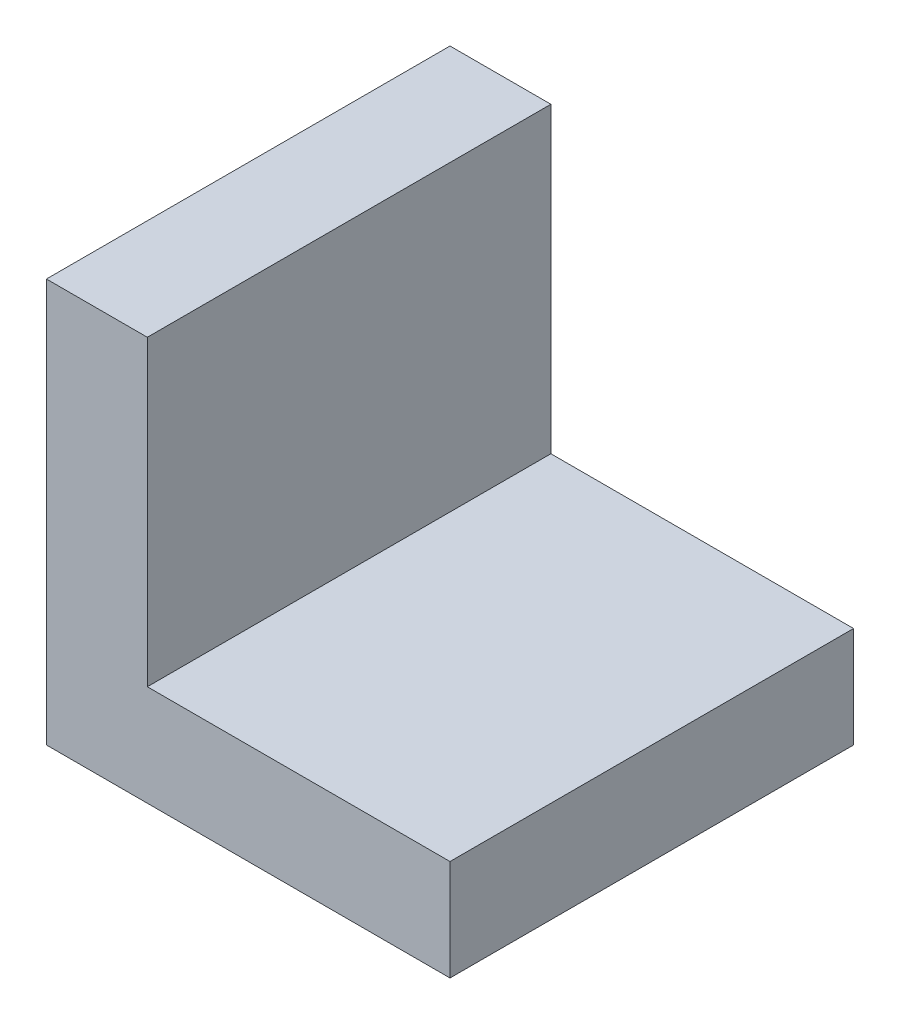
from build123d import *

# Parameters (mm, degrees)
BOSS_EXTRUDE1_DEPTH = 100


with BuildPart() as part:
    # Sketch1 → Boss-Extrude1 (new body)
    with BuildSketch(Plane.XY):
        Polygon((0, 100), (0, 0), (100, 0), (100, 25), (25, 25), (25, 100), align=None)
    extrude(amount=BOSS_EXTRUDE1_DEPTH)


solid = part.part
